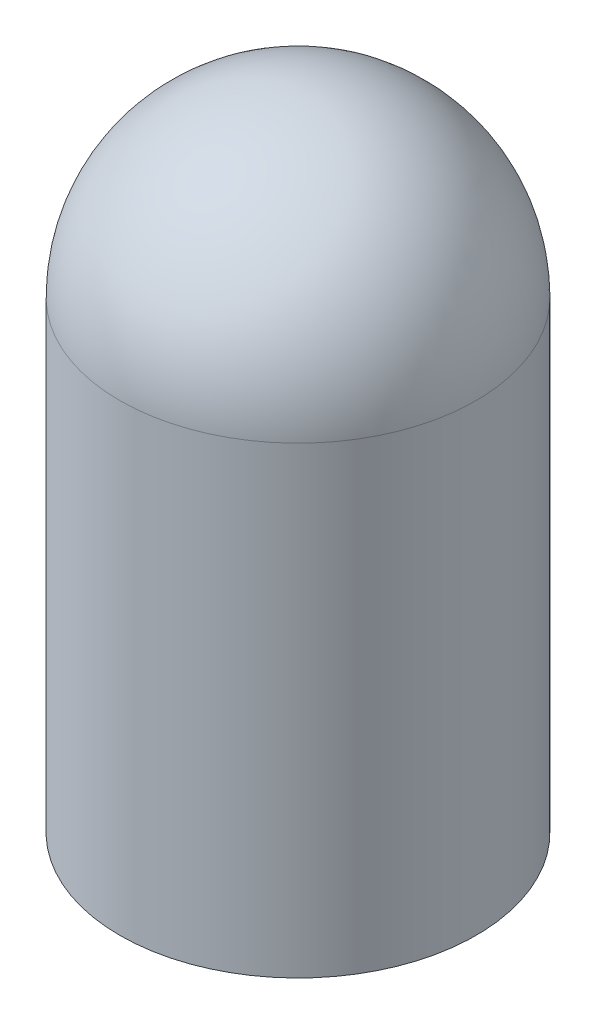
from build123d import *

# Parameters (mm, degrees)
SKETCH1_R                      = 5
BOSS_EXTRUDE1_DEPTH            = 18
FILLET7_R                      = 5
TAP_DRILL_FOR_10_32_TAP1_D     = 4.0386
TAP_DRILL_FOR_10_32_TAP1_DEPTH = 13
TAP_DRILL_FOR_10_32_TAP1_TIP   = 1.213317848


with BuildPart() as part:
    # Sketch1 → Boss-Extrude1 (new body)
    with BuildSketch(Plane(origin=(0, 0, 0), x_dir=(1, 0, 0), z_dir=(0, 1, 0))):
        with Locations(Location((0, 0, 0), (0, 0, 270))):
            Circle(SKETCH1_R)
    extrude(amount=BOSS_EXTRUDE1_DEPTH)

    # Fillet7
    fillet7_edges = [part.edges().sort_by_distance(p)[0] for p in [
        (0, 18, -5),
    ]]
    fillet(fillet7_edges, radius=FILLET7_R)

    # Tap Drill for _10-32 Tap1
    with Locations(Plane(origin=(0, 0, 0), x_dir=(-1, 0, 0), z_dir=(0, -1, 0))):
        with Locations((0, 0)):
            Hole(TAP_DRILL_FOR_10_32_TAP1_D / 2, depth=TAP_DRILL_FOR_10_32_TAP1_DEPTH)
            with Locations((0, 0, -(TAP_DRILL_FOR_10_32_TAP1_DEPTH + TAP_DRILL_FOR_10_32_TAP1_TIP / 2))):  # 118° drill point
                Cone(0, TAP_DRILL_FOR_10_32_TAP1_D / 2, TAP_DRILL_FOR_10_32_TAP1_TIP, mode=Mode.SUBTRACT)


solid = part.part
